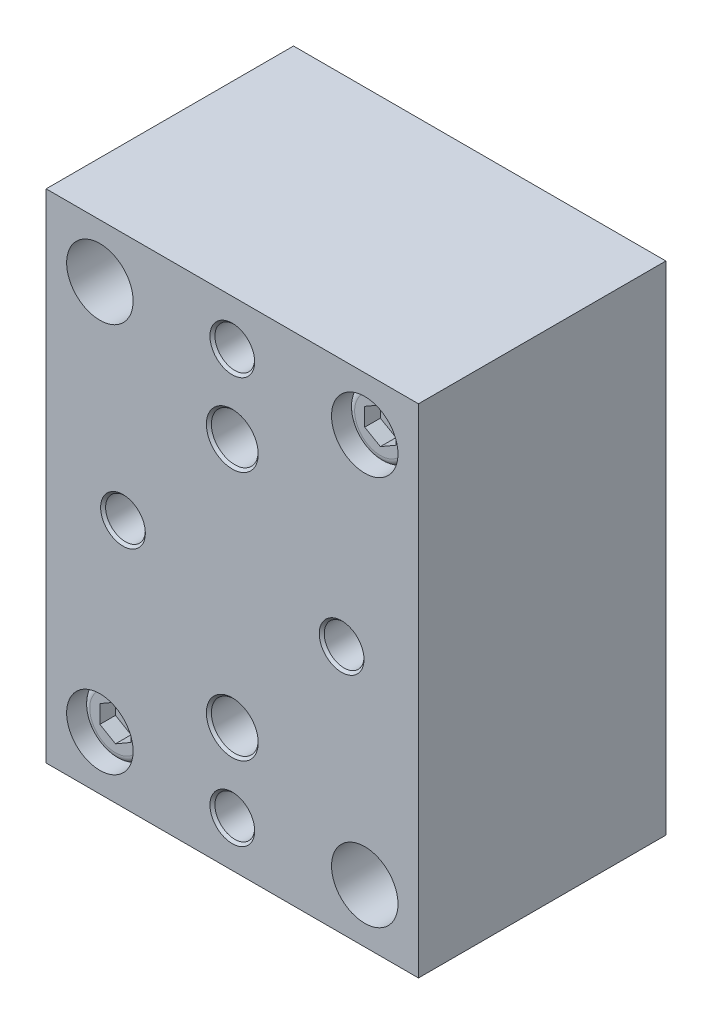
ISO-10303-21;
HEADER;
FILE_DESCRIPTION(('STEP AP214'),'2;1');
FILE_NAME('part.step','',(''),(''),'','','');
FILE_SCHEMA(('AUTOMOTIVE_DESIGN { 1 0 10303 214 1 1 1 1 }'));
ENDSEC;
DATA;
#1=APPLICATION_CONTEXT('core data for automotive mechanical design processes');
#2=APPLICATION_PROTOCOL_DEFINITION('international standard','automotive_design',2000,#1);
#3=PRODUCT_CONTEXT('',#1,'mechanical');
#4=PRODUCT('Part','Part','',(#3));
#5=PRODUCT_RELATED_PRODUCT_CATEGORY('part','',(#4));
#6=PRODUCT_DEFINITION_FORMATION('','',#4);
#7=PRODUCT_DEFINITION_CONTEXT('part definition',#1,'design');
#8=PRODUCT_DEFINITION('design','',#6,#7);
#9=PRODUCT_DEFINITION_SHAPE('','',#8);
#10=(LENGTH_UNIT() NAMED_UNIT(*) SI_UNIT(.MILLI.,.METRE.));
#11=(NAMED_UNIT(*) PLANE_ANGLE_UNIT() SI_UNIT($,.RADIAN.));
#12=(NAMED_UNIT(*) SI_UNIT($,.STERADIAN.) SOLID_ANGLE_UNIT());
#13=UNCERTAINTY_MEASURE_WITH_UNIT(LENGTH_MEASURE(1.E-05),#10,'distance_accuracy_value','');
#14=(GEOMETRIC_REPRESENTATION_CONTEXT(3) GLOBAL_UNCERTAINTY_ASSIGNED_CONTEXT((#13)) GLOBAL_UNIT_ASSIGNED_CONTEXT((#10,
#11,#12)) REPRESENTATION_CONTEXT('',''));
#15=CARTESIAN_POINT('',(0.,0.,0.));
#16=DIRECTION('',(0.,0.,1.));
#17=DIRECTION('',(1.,0.,0.));
#18=AXIS2_PLACEMENT_3D('',#15,#16,#17);
#19=CARTESIAN_POINT('',(-18.923,-25.273,23.5585));
#20=DIRECTION('',(0.,0.,1.));
#21=DIRECTION('',(1.,0.,0.));
#22=AXIS2_PLACEMENT_3D('',#19,#20,#21);
#23=PLANE('',#22);
#24=DIRECTION('',(-0.866025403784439,0.5,0.));
#25=VECTOR('',#24,1.);
#26=CARTESIAN_POINT('',(-11.8745,-18.8954564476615,23.5585));
#27=LINE('',#26,#25);
#28=CARTESIAN_POINT('',(-11.8745,-18.8954564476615,23.5585));
#29=VERTEX_POINT('',#28);
#30=CARTESIAN_POINT('',(-13.462,-17.9789128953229,23.5585));
#31=VERTEX_POINT('',#30);
#32=EDGE_CURVE('E61',#29,#31,#27,.T.);
#33=ORIENTED_EDGE('',*,*,#32,.F.);
#34=DIRECTION('',(0.,1.,0.));
#35=VECTOR('',#34,1.);
#36=CARTESIAN_POINT('',(-11.8745,-20.7285435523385,23.5585));
#37=LINE('',#36,#35);
#38=CARTESIAN_POINT('',(-11.8745,-20.7285435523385,23.5585));
#39=VERTEX_POINT('',#38);
#40=EDGE_CURVE('E144',#39,#29,#37,.T.);
#41=ORIENTED_EDGE('',*,*,#40,.F.);
#42=DIRECTION('',(0.866025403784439,0.5,0.));
#43=VECTOR('',#42,1.);
#44=CARTESIAN_POINT('',(-13.462,-21.6450871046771,23.5585));
#45=LINE('',#44,#43);
#46=CARTESIAN_POINT('',(-13.462,-21.6450871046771,23.5585));
#47=VERTEX_POINT('',#46);
#48=EDGE_CURVE('E142',#47,#39,#45,.T.);
#49=ORIENTED_EDGE('',*,*,#48,.F.);
#50=DIRECTION('',(0.866025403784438,-0.5,0.));
#51=VECTOR('',#50,1.);
#52=CARTESIAN_POINT('',(-15.0495,-20.7285435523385,23.5585));
#53=LINE('',#52,#51);
#54=CARTESIAN_POINT('',(-15.0495,-20.7285435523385,23.5585));
#55=VERTEX_POINT('',#54);
#56=EDGE_CURVE('E109',#55,#47,#53,.T.);
#57=ORIENTED_EDGE('',*,*,#56,.F.);
#58=DIRECTION('',(0.,-1.,0.));
#59=VECTOR('',#58,1.);
#60=CARTESIAN_POINT('',(-15.0495,-18.8954564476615,23.5585));
#61=LINE('',#60,#59);
#62=CARTESIAN_POINT('',(-15.0495,-18.8954564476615,23.5585));
#63=VERTEX_POINT('',#62);
#64=EDGE_CURVE('E138',#63,#55,#61,.T.);
#65=ORIENTED_EDGE('',*,*,#64,.F.);
#66=DIRECTION('',(-0.866025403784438,-0.5,0.));
#67=VECTOR('',#66,1.);
#68=CARTESIAN_POINT('',(-13.462,-17.9789128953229,23.5585));
#69=LINE('',#68,#67);
#70=EDGE_CURVE('E135',#31,#63,#69,.T.);
#71=ORIENTED_EDGE('',*,*,#70,.F.);
#72=EDGE_LOOP('',(#33,#41,#49,#57,#65,#71));
#73=FACE_BOUND('',#72,.T.);
#74=CARTESIAN_POINT('',(-13.462,-19.812,23.5585));
#75=DIRECTION('',(0.,0.,1.));
#76=DIRECTION('',(1.,0.,0.));
#77=AXIS2_PLACEMENT_3D('',#74,#75,#76);
#78=CIRCLE('',#77,2.6162);
#79=CARTESIAN_POINT('',(-10.8458,-19.812,23.5585));
#80=VERTEX_POINT('',#79);
#81=EDGE_CURVE('E12',#80,#80,#78,.T.);
#82=ORIENTED_EDGE('',*,*,#81,.T.);
#83=EDGE_LOOP('',(#82));
#84=FACE_BOUND('',#83,.T.);
#85=ADVANCED_FACE('F46',(#73,#84),#23,.T.);
#86=CARTESIAN_POINT('',(-13.462,-19.812,0.));
#87=DIRECTION('',(0.,0.,-1.));
#88=DIRECTION('',(-1.,0.,0.));
#89=AXIS2_PLACEMENT_3D('',#86,#87,#88);
#90=PLANE('',#89);
#91=CARTESIAN_POINT('',(-13.462,-19.812,0.));
#92=DIRECTION('',(0.,0.,-1.));
#93=DIRECTION('',(-1.,0.,0.));
#94=AXIS2_PLACEMENT_3D('',#91,#92,#93);
#95=CIRCLE('',#94,3.3782);
#96=CARTESIAN_POINT('',(-16.8402,-19.812,0.));
#97=VERTEX_POINT('',#96);
#98=EDGE_CURVE('E148',#97,#97,#95,.T.);
#99=ORIENTED_EDGE('',*,*,#98,.T.);
#100=EDGE_LOOP('',(#99));
#101=FACE_BOUND('',#100,.T.);
#102=ADVANCED_FACE('F170',(#101),#90,.T.);
#103=CARTESIAN_POINT('',(-13.462,-19.812,34.7009925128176));
#104=DIRECTION('',(0.,0.,-1.));
#105=DIRECTION('',(-1.,0.,0.));
#106=AXIS2_PLACEMENT_3D('',#103,#104,#105);
#107=CYLINDRICAL_SURFACE('',#106,3.3782);
#108=CARTESIAN_POINT('',(-13.462,-19.812,22.7965));
#109=DIRECTION('',(0.,0.,1.));
#110=DIRECTION('',(1.,0.,0.));
#111=AXIS2_PLACEMENT_3D('',#108,#109,#110);
#112=CIRCLE('',#111,3.3782);
#113=CARTESIAN_POINT('',(-10.0838,-19.812,22.7965));
#114=VERTEX_POINT('',#113);
#115=EDGE_CURVE('E54',#114,#114,#112,.F.);
#116=ORIENTED_EDGE('',*,*,#115,.T.);
#117=EDGE_LOOP('',(#116));
#118=FACE_BOUND('',#117,.T.);
#119=ORIENTED_EDGE('',*,*,#98,.F.);
#120=EDGE_LOOP('',(#119));
#121=FACE_BOUND('',#120,.T.);
#122=ADVANCED_FACE('F158',(#118,#121),#107,.T.);
#123=CARTESIAN_POINT('',(-13.462,-19.812,22.7965));
#124=DIRECTION('',(0.,0.,1.));
#125=DIRECTION('',(1.,0.,0.));
#126=AXIS2_PLACEMENT_3D('',#123,#124,#125);
#127=TOROIDAL_SURFACE('',#126,2.6162,0.762);
#128=ORIENTED_EDGE('',*,*,#81,.F.);
#129=EDGE_LOOP('',(#128));
#130=FACE_BOUND('',#129,.T.);
#131=ORIENTED_EDGE('',*,*,#115,.F.);
#132=EDGE_LOOP('',(#131));
#133=FACE_BOUND('',#132,.T.);
#134=ADVANCED_FACE('F48',(#130,#133),#127,.T.);
#135=CARTESIAN_POINT('',(-11.8745,-18.8954564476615,21.971));
#136=DIRECTION('',(0.5,0.866025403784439,0.));
#137=DIRECTION('',(-0.866025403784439,0.5,0.));
#138=AXIS2_PLACEMENT_3D('',#135,#136,#137);
#139=PLANE('',#138);
#140=ORIENTED_EDGE('',*,*,#32,.T.);
#141=DIRECTION('',(0.,0.,1.));
#142=VECTOR('',#141,1.);
#143=CARTESIAN_POINT('',(-13.462,-17.9789128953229,21.971));
#144=LINE('',#143,#142);
#145=CARTESIAN_POINT('',(-13.462,-17.9789128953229,21.971));
#146=VERTEX_POINT('',#145);
#147=EDGE_CURVE('E91',#146,#31,#144,.T.);
#148=ORIENTED_EDGE('',*,*,#147,.F.);
#149=DIRECTION('',(-0.866025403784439,0.5,0.));
#150=VECTOR('',#149,1.);
#151=CARTESIAN_POINT('',(-11.8745,-18.8954564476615,21.971));
#152=LINE('',#151,#150);
#153=CARTESIAN_POINT('',(-11.8745,-18.8954564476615,21.971));
#154=VERTEX_POINT('',#153);
#155=EDGE_CURVE('E146',#154,#146,#152,.T.);
#156=ORIENTED_EDGE('',*,*,#155,.F.);
#157=DIRECTION('',(0.,0.,1.));
#158=VECTOR('',#157,1.);
#159=CARTESIAN_POINT('',(-11.8745,-18.8954564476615,21.971));
#160=LINE('',#159,#158);
#161=EDGE_CURVE('E69',#154,#29,#160,.T.);
#162=ORIENTED_EDGE('',*,*,#161,.T.);
#163=EDGE_LOOP('',(#140,#148,#156,#162));
#164=FACE_BOUND('',#163,.T.);
#165=ADVANCED_FACE('F162',(#164),#139,.F.);
#166=CARTESIAN_POINT('',(-11.8745,-20.7285435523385,21.971));
#167=DIRECTION('',(1.,0.,0.));
#168=DIRECTION('',(0.,0.,-1.));
#169=AXIS2_PLACEMENT_3D('',#166,#167,#168);
#170=PLANE('',#169);
#171=ORIENTED_EDGE('',*,*,#40,.T.);
#172=ORIENTED_EDGE('',*,*,#161,.F.);
#173=DIRECTION('',(0.,1.,0.));
#174=VECTOR('',#173,1.);
#175=CARTESIAN_POINT('',(-11.8745,-20.7285435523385,21.971));
#176=LINE('',#175,#174);
#177=CARTESIAN_POINT('',(-11.8745,-20.7285435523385,21.971));
#178=VERTEX_POINT('',#177);
#179=EDGE_CURVE('E121',#178,#154,#176,.T.);
#180=ORIENTED_EDGE('',*,*,#179,.F.);
#181=DIRECTION('',(0.,0.,1.));
#182=VECTOR('',#181,1.);
#183=CARTESIAN_POINT('',(-11.8745,-20.7285435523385,21.971));
#184=LINE('',#183,#182);
#185=EDGE_CURVE('E113',#178,#39,#184,.T.);
#186=ORIENTED_EDGE('',*,*,#185,.T.);
#187=EDGE_LOOP('',(#171,#172,#180,#186));
#188=FACE_BOUND('',#187,.T.);
#189=ADVANCED_FACE('F168',(#188),#170,.F.);
#190=CARTESIAN_POINT('',(-13.462,-21.6450871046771,21.971));
#191=DIRECTION('',(0.5,-0.866025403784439,0.));
#192=DIRECTION('',(0.866025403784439,0.5,0.));
#193=AXIS2_PLACEMENT_3D('',#190,#191,#192);
#194=PLANE('',#193);
#195=ORIENTED_EDGE('',*,*,#48,.T.);
#196=ORIENTED_EDGE('',*,*,#185,.F.);
#197=DIRECTION('',(0.866025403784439,0.5,0.));
#198=VECTOR('',#197,1.);
#199=CARTESIAN_POINT('',(-13.462,-21.6450871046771,21.971));
#200=LINE('',#199,#198);
#201=CARTESIAN_POINT('',(-13.462,-21.6450871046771,21.971));
#202=VERTEX_POINT('',#201);
#203=EDGE_CURVE('E117',#202,#178,#200,.T.);
#204=ORIENTED_EDGE('',*,*,#203,.F.);
#205=DIRECTION('',(0.,0.,1.));
#206=VECTOR('',#205,1.);
#207=CARTESIAN_POINT('',(-13.462,-21.6450871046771,21.971));
#208=LINE('',#207,#206);
#209=EDGE_CURVE('E102',#202,#47,#208,.T.);
#210=ORIENTED_EDGE('',*,*,#209,.T.);
#211=EDGE_LOOP('',(#195,#196,#204,#210));
#212=FACE_BOUND('',#211,.T.);
#213=ADVANCED_FACE('F118',(#212),#194,.F.);
#214=CARTESIAN_POINT('',(-15.0495,-20.7285435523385,21.971));
#215=DIRECTION('',(-0.5,-0.866025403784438,0.));
#216=DIRECTION('',(0.866025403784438,-0.5,0.));
#217=AXIS2_PLACEMENT_3D('',#214,#215,#216);
#218=PLANE('',#217);
#219=ORIENTED_EDGE('',*,*,#56,.T.);
#220=ORIENTED_EDGE('',*,*,#209,.F.);
#221=DIRECTION('',(0.866025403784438,-0.5,0.));
#222=VECTOR('',#221,1.);
#223=CARTESIAN_POINT('',(-15.0495,-20.7285435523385,21.971));
#224=LINE('',#223,#222);
#225=CARTESIAN_POINT('',(-15.0495,-20.7285435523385,21.971));
#226=VERTEX_POINT('',#225);
#227=EDGE_CURVE('E106',#226,#202,#224,.T.);
#228=ORIENTED_EDGE('',*,*,#227,.F.);
#229=DIRECTION('',(0.,0.,1.));
#230=VECTOR('',#229,1.);
#231=CARTESIAN_POINT('',(-15.0495,-20.7285435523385,21.971));
#232=LINE('',#231,#230);
#233=EDGE_CURVE('E114',#226,#55,#232,.T.);
#234=ORIENTED_EDGE('',*,*,#233,.T.);
#235=EDGE_LOOP('',(#219,#220,#228,#234));
#236=FACE_BOUND('',#235,.T.);
#237=ADVANCED_FACE('F104',(#236),#218,.F.);
#238=CARTESIAN_POINT('',(-15.0495,-18.8954564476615,21.971));
#239=DIRECTION('',(-1.,0.,0.));
#240=DIRECTION('',(0.,0.,1.));
#241=AXIS2_PLACEMENT_3D('',#238,#239,#240);
#242=PLANE('',#241);
#243=ORIENTED_EDGE('',*,*,#64,.T.);
#244=ORIENTED_EDGE('',*,*,#233,.F.);
#245=DIRECTION('',(0.,-1.,0.));
#246=VECTOR('',#245,1.);
#247=CARTESIAN_POINT('',(-15.0495,-18.8954564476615,21.971));
#248=LINE('',#247,#246);
#249=CARTESIAN_POINT('',(-15.0495,-18.8954564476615,21.971));
#250=VERTEX_POINT('',#249);
#251=EDGE_CURVE('E127',#250,#226,#248,.T.);
#252=ORIENTED_EDGE('',*,*,#251,.F.);
#253=DIRECTION('',(0.,0.,1.));
#254=VECTOR('',#253,1.);
#255=CARTESIAN_POINT('',(-15.0495,-18.8954564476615,21.971));
#256=LINE('',#255,#254);
#257=EDGE_CURVE('E151',#250,#63,#256,.T.);
#258=ORIENTED_EDGE('',*,*,#257,.T.);
#259=EDGE_LOOP('',(#243,#244,#252,#258));
#260=FACE_BOUND('',#259,.T.);
#261=ADVANCED_FACE('F185',(#260),#242,.F.);
#262=CARTESIAN_POINT('',(-13.462,-17.9789128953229,21.971));
#263=DIRECTION('',(-0.5,0.866025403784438,0.));
#264=DIRECTION('',(-0.866025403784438,-0.5,0.));
#265=AXIS2_PLACEMENT_3D('',#262,#263,#264);
#266=PLANE('',#265);
#267=ORIENTED_EDGE('',*,*,#70,.T.);
#268=ORIENTED_EDGE('',*,*,#257,.F.);
#269=DIRECTION('',(-0.866025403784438,-0.5,0.));
#270=VECTOR('',#269,1.);
#271=CARTESIAN_POINT('',(-13.462,-17.9789128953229,21.971));
#272=LINE('',#271,#270);
#273=EDGE_CURVE('E129',#146,#250,#272,.T.);
#274=ORIENTED_EDGE('',*,*,#273,.F.);
#275=ORIENTED_EDGE('',*,*,#147,.T.);
#276=EDGE_LOOP('',(#267,#268,#274,#275));
#277=FACE_BOUND('',#276,.T.);
#278=ADVANCED_FACE('F182',(#277),#266,.F.);
#279=CARTESIAN_POINT('',(0.,0.,21.971));
#280=DIRECTION('',(0.,0.,1.));
#281=DIRECTION('',(1.,0.,0.));
#282=AXIS2_PLACEMENT_3D('',#279,#280,#281);
#283=PLANE('',#282);
#284=ORIENTED_EDGE('',*,*,#155,.T.);
#285=ORIENTED_EDGE('',*,*,#273,.T.);
#286=ORIENTED_EDGE('',*,*,#251,.T.);
#287=ORIENTED_EDGE('',*,*,#227,.T.);
#288=ORIENTED_EDGE('',*,*,#203,.T.);
#289=ORIENTED_EDGE('',*,*,#179,.T.);
#290=EDGE_LOOP('',(#284,#285,#286,#287,#288,#289));
#291=FACE_BOUND('',#290,.T.);
#292=ADVANCED_FACE('F124',(#291),#283,.T.);
#293=CLOSED_SHELL('',(#85,#102,#122,#134,#165,#189,#213,#237,#261,#278,#292));
#294=MANIFOLD_SOLID_BREP('B2',#293);
#295=CARTESIAN_POINT('',(-18.923,-25.273,23.5585));
#296=DIRECTION('',(0.,0.,1.));
#297=DIRECTION('',(1.,0.,0.));
#298=AXIS2_PLACEMENT_3D('',#295,#296,#297);
#299=PLANE('',#298);
#300=DIRECTION('',(-0.866025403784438,0.5,0.));
#301=VECTOR('',#300,1.);
#302=CARTESIAN_POINT('',(15.0495,20.7285435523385,23.5585));
#303=LINE('',#302,#301);
#304=CARTESIAN_POINT('',(15.0495,20.7285435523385,23.5585));
#305=VERTEX_POINT('',#304);
#306=CARTESIAN_POINT('',(13.462,21.6450871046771,23.5585));
#307=VERTEX_POINT('',#306);
#308=EDGE_CURVE('E292',#305,#307,#303,.T.);
#309=ORIENTED_EDGE('',*,*,#308,.F.);
#310=DIRECTION('',(0.,1.,0.));
#311=VECTOR('',#310,1.);
#312=CARTESIAN_POINT('',(15.0495,18.8954564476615,23.5585));
#313=LINE('',#312,#311);
#314=CARTESIAN_POINT('',(15.0495,18.8954564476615,23.5585));
#315=VERTEX_POINT('',#314);
#316=EDGE_CURVE('E375',#315,#305,#313,.T.);
#317=ORIENTED_EDGE('',*,*,#316,.F.);
#318=DIRECTION('',(0.866025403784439,0.499999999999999,0.));
#319=VECTOR('',#318,1.);
#320=CARTESIAN_POINT('',(13.462,17.9789128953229,23.5585));
#321=LINE('',#320,#319);
#322=CARTESIAN_POINT('',(13.462,17.9789128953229,23.5585));
#323=VERTEX_POINT('',#322);
#324=EDGE_CURVE('E373',#323,#315,#321,.T.);
#325=ORIENTED_EDGE('',*,*,#324,.F.);
#326=DIRECTION('',(0.866025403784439,-0.499999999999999,0.));
#327=VECTOR('',#326,1.);
#328=CARTESIAN_POINT('',(11.8745,18.8954564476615,23.5585));
#329=LINE('',#328,#327);
#330=CARTESIAN_POINT('',(11.8745,18.8954564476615,23.5585));
#331=VERTEX_POINT('',#330);
#332=EDGE_CURVE('E340',#331,#323,#329,.T.);
#333=ORIENTED_EDGE('',*,*,#332,.F.);
#334=DIRECTION('',(0.,-1.,0.));
#335=VECTOR('',#334,1.);
#336=CARTESIAN_POINT('',(11.8745,20.7285435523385,23.5585));
#337=LINE('',#336,#335);
#338=CARTESIAN_POINT('',(11.8745,20.7285435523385,23.5585));
#339=VERTEX_POINT('',#338);
#340=EDGE_CURVE('E369',#339,#331,#337,.T.);
#341=ORIENTED_EDGE('',*,*,#340,.F.);
#342=DIRECTION('',(-0.866025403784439,-0.5,0.));
#343=VECTOR('',#342,1.);
#344=CARTESIAN_POINT('',(13.462,21.6450871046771,23.5585));
#345=LINE('',#344,#343);
#346=EDGE_CURVE('E366',#307,#339,#345,.T.);
#347=ORIENTED_EDGE('',*,*,#346,.F.);
#348=EDGE_LOOP('',(#309,#317,#325,#333,#341,#347));
#349=FACE_BOUND('',#348,.T.);
#350=CARTESIAN_POINT('',(13.462,19.812,23.5585));
#351=DIRECTION('',(0.,0.,1.));
#352=DIRECTION('',(1.,0.,0.));
#353=AXIS2_PLACEMENT_3D('',#350,#351,#352);
#354=CIRCLE('',#353,2.6162);
#355=CARTESIAN_POINT('',(16.0782,19.812,23.5585));
#356=VERTEX_POINT('',#355);
#357=EDGE_CURVE('E44',#356,#356,#354,.T.);
#358=ORIENTED_EDGE('',*,*,#357,.T.);
#359=EDGE_LOOP('',(#358));
#360=FACE_BOUND('',#359,.T.);
#361=ADVANCED_FACE('F277',(#349,#360),#299,.T.);
#362=CARTESIAN_POINT('',(13.462,19.812,0.));
#363=DIRECTION('',(0.,0.,-1.));
#364=DIRECTION('',(-1.,0.,0.));
#365=AXIS2_PLACEMENT_3D('',#362,#363,#364);
#366=PLANE('',#365);
#367=CARTESIAN_POINT('',(13.462,19.812,0.));
#368=DIRECTION('',(0.,0.,-1.));
#369=DIRECTION('',(-1.,0.,0.));
#370=AXIS2_PLACEMENT_3D('',#367,#368,#369);
#371=CIRCLE('',#370,3.3782);
#372=CARTESIAN_POINT('',(10.0838,19.812,0.));
#373=VERTEX_POINT('',#372);
#374=EDGE_CURVE('E379',#373,#373,#371,.T.);
#375=ORIENTED_EDGE('',*,*,#374,.T.);
#376=EDGE_LOOP('',(#375));
#377=FACE_BOUND('',#376,.T.);
#378=ADVANCED_FACE('F401',(#377),#366,.T.);
#379=CARTESIAN_POINT('',(13.462,19.812,34.7009925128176));
#380=DIRECTION('',(0.,0.,-1.));
#381=DIRECTION('',(-1.,0.,0.));
#382=AXIS2_PLACEMENT_3D('',#379,#380,#381);
#383=CYLINDRICAL_SURFACE('',#382,3.3782);
#384=CARTESIAN_POINT('',(13.462,19.812,22.7965));
#385=DIRECTION('',(0.,0.,1.));
#386=DIRECTION('',(1.,0.,0.));
#387=AXIS2_PLACEMENT_3D('',#384,#385,#386);
#388=CIRCLE('',#387,3.3782);
#389=CARTESIAN_POINT('',(16.8402,19.812,22.7965));
#390=VERTEX_POINT('',#389);
#391=EDGE_CURVE('E285',#390,#390,#388,.F.);
#392=ORIENTED_EDGE('',*,*,#391,.T.);
#393=EDGE_LOOP('',(#392));
#394=FACE_BOUND('',#393,.T.);
#395=ORIENTED_EDGE('',*,*,#374,.F.);
#396=EDGE_LOOP('',(#395));
#397=FACE_BOUND('',#396,.T.);
#398=ADVANCED_FACE('F389',(#394,#397),#383,.T.);
#399=CARTESIAN_POINT('',(13.462,19.812,22.7965));
#400=DIRECTION('',(0.,0.,1.));
#401=DIRECTION('',(1.,0.,0.));
#402=AXIS2_PLACEMENT_3D('',#399,#400,#401);
#403=TOROIDAL_SURFACE('',#402,2.6162,0.762);
#404=ORIENTED_EDGE('',*,*,#357,.F.);
#405=EDGE_LOOP('',(#404));
#406=FACE_BOUND('',#405,.T.);
#407=ORIENTED_EDGE('',*,*,#391,.F.);
#408=EDGE_LOOP('',(#407));
#409=FACE_BOUND('',#408,.T.);
#410=ADVANCED_FACE('F279',(#406,#409),#403,.T.);
#411=CARTESIAN_POINT('',(15.0495,20.7285435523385,21.971));
#412=DIRECTION('',(0.5,0.866025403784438,0.));
#413=DIRECTION('',(-0.866025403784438,0.5,0.));
#414=AXIS2_PLACEMENT_3D('',#411,#412,#413);
#415=PLANE('',#414);
#416=ORIENTED_EDGE('',*,*,#308,.T.);
#417=DIRECTION('',(0.,0.,1.));
#418=VECTOR('',#417,1.);
#419=CARTESIAN_POINT('',(13.462,21.6450871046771,21.971));
#420=LINE('',#419,#418);
#421=CARTESIAN_POINT('',(13.462,21.6450871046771,21.971));
#422=VERTEX_POINT('',#421);
#423=EDGE_CURVE('E322',#422,#307,#420,.T.);
#424=ORIENTED_EDGE('',*,*,#423,.F.);
#425=DIRECTION('',(-0.866025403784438,0.5,0.));
#426=VECTOR('',#425,1.);
#427=CARTESIAN_POINT('',(15.0495,20.7285435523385,21.971));
#428=LINE('',#427,#426);
#429=CARTESIAN_POINT('',(15.0495,20.7285435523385,21.971));
#430=VERTEX_POINT('',#429);
#431=EDGE_CURVE('E377',#430,#422,#428,.T.);
#432=ORIENTED_EDGE('',*,*,#431,.F.);
#433=DIRECTION('',(0.,0.,1.));
#434=VECTOR('',#433,1.);
#435=CARTESIAN_POINT('',(15.0495,20.7285435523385,21.971));
#436=LINE('',#435,#434);
#437=EDGE_CURVE('E300',#430,#305,#436,.T.);
#438=ORIENTED_EDGE('',*,*,#437,.T.);
#439=EDGE_LOOP('',(#416,#424,#432,#438));
#440=FACE_BOUND('',#439,.T.);
#441=ADVANCED_FACE('F393',(#440),#415,.F.);
#442=CARTESIAN_POINT('',(15.0495,18.8954564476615,21.971));
#443=DIRECTION('',(1.,0.,0.));
#444=DIRECTION('',(0.,0.,-1.));
#445=AXIS2_PLACEMENT_3D('',#442,#443,#444);
#446=PLANE('',#445);
#447=ORIENTED_EDGE('',*,*,#316,.T.);
#448=ORIENTED_EDGE('',*,*,#437,.F.);
#449=DIRECTION('',(0.,1.,0.));
#450=VECTOR('',#449,1.);
#451=CARTESIAN_POINT('',(15.0495,18.8954564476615,21.971));
#452=LINE('',#451,#450);
#453=CARTESIAN_POINT('',(15.0495,18.8954564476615,21.971));
#454=VERTEX_POINT('',#453);
#455=EDGE_CURVE('E352',#454,#430,#452,.T.);
#456=ORIENTED_EDGE('',*,*,#455,.F.);
#457=DIRECTION('',(0.,0.,1.));
#458=VECTOR('',#457,1.);
#459=CARTESIAN_POINT('',(15.0495,18.8954564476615,21.971));
#460=LINE('',#459,#458);
#461=EDGE_CURVE('E344',#454,#315,#460,.T.);
#462=ORIENTED_EDGE('',*,*,#461,.T.);
#463=EDGE_LOOP('',(#447,#448,#456,#462));
#464=FACE_BOUND('',#463,.T.);
#465=ADVANCED_FACE('F399',(#464),#446,.F.);
#466=CARTESIAN_POINT('',(13.462,17.9789128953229,21.971));
#467=DIRECTION('',(0.499999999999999,-0.866025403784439,0.));
#468=DIRECTION('',(0.86602540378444,0.499999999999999,0.));
#469=AXIS2_PLACEMENT_3D('',#466,#467,#468);
#470=PLANE('',#469);
#471=ORIENTED_EDGE('',*,*,#324,.T.);
#472=ORIENTED_EDGE('',*,*,#461,.F.);
#473=DIRECTION('',(0.866025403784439,0.499999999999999,0.));
#474=VECTOR('',#473,1.);
#475=CARTESIAN_POINT('',(13.462,17.9789128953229,21.971));
#476=LINE('',#475,#474);
#477=CARTESIAN_POINT('',(13.462,17.9789128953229,21.971));
#478=VERTEX_POINT('',#477);
#479=EDGE_CURVE('E348',#478,#454,#476,.T.);
#480=ORIENTED_EDGE('',*,*,#479,.F.);
#481=DIRECTION('',(0.,0.,1.));
#482=VECTOR('',#481,1.);
#483=CARTESIAN_POINT('',(13.462,17.9789128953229,21.971));
#484=LINE('',#483,#482);
#485=EDGE_CURVE('E333',#478,#323,#484,.T.);
#486=ORIENTED_EDGE('',*,*,#485,.T.);
#487=EDGE_LOOP('',(#471,#472,#480,#486));
#488=FACE_BOUND('',#487,.T.);
#489=ADVANCED_FACE('F349',(#488),#470,.F.);
#490=CARTESIAN_POINT('',(11.8745,18.8954564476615,21.971));
#491=DIRECTION('',(-0.499999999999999,-0.866025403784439,0.));
#492=DIRECTION('',(0.866025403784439,-0.499999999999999,0.));
#493=AXIS2_PLACEMENT_3D('',#490,#491,#492);
#494=PLANE('',#493);
#495=ORIENTED_EDGE('',*,*,#332,.T.);
#496=ORIENTED_EDGE('',*,*,#485,.F.);
#497=DIRECTION('',(0.866025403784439,-0.499999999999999,0.));
#498=VECTOR('',#497,1.);
#499=CARTESIAN_POINT('',(11.8745,18.8954564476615,21.971));
#500=LINE('',#499,#498);
#501=CARTESIAN_POINT('',(11.8745,18.8954564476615,21.971));
#502=VERTEX_POINT('',#501);
#503=EDGE_CURVE('E337',#502,#478,#500,.T.);
#504=ORIENTED_EDGE('',*,*,#503,.F.);
#505=DIRECTION('',(0.,0.,1.));
#506=VECTOR('',#505,1.);
#507=CARTESIAN_POINT('',(11.8745,18.8954564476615,21.971));
#508=LINE('',#507,#506);
#509=EDGE_CURVE('E345',#502,#331,#508,.T.);
#510=ORIENTED_EDGE('',*,*,#509,.T.);
#511=EDGE_LOOP('',(#495,#496,#504,#510));
#512=FACE_BOUND('',#511,.T.);
#513=ADVANCED_FACE('F335',(#512),#494,.F.);
#514=CARTESIAN_POINT('',(11.8745,20.7285435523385,21.971));
#515=DIRECTION('',(-1.,0.,0.));
#516=DIRECTION('',(0.,0.,1.));
#517=AXIS2_PLACEMENT_3D('',#514,#515,#516);
#518=PLANE('',#517);
#519=ORIENTED_EDGE('',*,*,#340,.T.);
#520=ORIENTED_EDGE('',*,*,#509,.F.);
#521=DIRECTION('',(0.,-1.,0.));
#522=VECTOR('',#521,1.);
#523=CARTESIAN_POINT('',(11.8745,20.7285435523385,21.971));
#524=LINE('',#523,#522);
#525=CARTESIAN_POINT('',(11.8745,20.7285435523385,21.971));
#526=VERTEX_POINT('',#525);
#527=EDGE_CURVE('E358',#526,#502,#524,.T.);
#528=ORIENTED_EDGE('',*,*,#527,.F.);
#529=DIRECTION('',(0.,0.,1.));
#530=VECTOR('',#529,1.);
#531=CARTESIAN_POINT('',(11.8745,20.7285435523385,21.971));
#532=LINE('',#531,#530);
#533=EDGE_CURVE('E382',#526,#339,#532,.T.);
#534=ORIENTED_EDGE('',*,*,#533,.T.);
#535=EDGE_LOOP('',(#519,#520,#528,#534));
#536=FACE_BOUND('',#535,.T.);
#537=ADVANCED_FACE('F416',(#536),#518,.F.);
#538=CARTESIAN_POINT('',(13.462,21.6450871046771,21.971));
#539=DIRECTION('',(-0.5,0.866025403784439,0.));
#540=DIRECTION('',(-0.866025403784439,-0.5,0.));
#541=AXIS2_PLACEMENT_3D('',#538,#539,#540);
#542=PLANE('',#541);
#543=ORIENTED_EDGE('',*,*,#346,.T.);
#544=ORIENTED_EDGE('',*,*,#533,.F.);
#545=DIRECTION('',(-0.866025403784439,-0.5,0.));
#546=VECTOR('',#545,1.);
#547=CARTESIAN_POINT('',(13.462,21.6450871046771,21.971));
#548=LINE('',#547,#546);
#549=EDGE_CURVE('E360',#422,#526,#548,.T.);
#550=ORIENTED_EDGE('',*,*,#549,.F.);
#551=ORIENTED_EDGE('',*,*,#423,.T.);
#552=EDGE_LOOP('',(#543,#544,#550,#551));
#553=FACE_BOUND('',#552,.T.);
#554=ADVANCED_FACE('F413',(#553),#542,.F.);
#555=CARTESIAN_POINT('',(0.,0.,21.971));
#556=DIRECTION('',(0.,0.,1.));
#557=DIRECTION('',(1.,0.,0.));
#558=AXIS2_PLACEMENT_3D('',#555,#556,#557);
#559=PLANE('',#558);
#560=ORIENTED_EDGE('',*,*,#431,.T.);
#561=ORIENTED_EDGE('',*,*,#549,.T.);
#562=ORIENTED_EDGE('',*,*,#527,.T.);
#563=ORIENTED_EDGE('',*,*,#503,.T.);
#564=ORIENTED_EDGE('',*,*,#479,.T.);
#565=ORIENTED_EDGE('',*,*,#455,.T.);
#566=EDGE_LOOP('',(#560,#561,#562,#563,#564,#565));
#567=FACE_BOUND('',#566,.T.);
#568=ADVANCED_FACE('F355',(#567),#559,.T.);
#569=CLOSED_SHELL('',(#361,#378,#398,#410,#441,#465,#489,#513,#537,#554,#568));
#570=MANIFOLD_SOLID_BREP('B6',#569);
#571=CARTESIAN_POINT('',(-18.923,-25.273,25.146));
#572=DIRECTION('',(0.,0.,1.));
#573=DIRECTION('',(1.,0.,0.));
#574=AXIS2_PLACEMENT_3D('',#571,#572,#573);
#575=PLANE('',#574);
#576=CARTESIAN_POINT('',(-11.1125,0.,25.146));
#577=DIRECTION('',(0.,0.,1.));
#578=DIRECTION('',(1.,0.,0.));
#579=AXIS2_PLACEMENT_3D('',#576,#577,#578);
#580=CIRCLE('',#579,2.27329999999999);
#581=CARTESIAN_POINT('',(-8.83920000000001,0.,25.146));
#582=VERTEX_POINT('',#581);
#583=EDGE_CURVE('E595',#582,#582,#580,.F.);
#584=ORIENTED_EDGE('',*,*,#583,.T.);
#585=EDGE_LOOP('',(#584));
#586=FACE_BOUND('',#585,.T.);
#587=CARTESIAN_POINT('',(11.1125,0.,25.146));
#588=DIRECTION('',(0.,0.,1.));
#589=DIRECTION('',(1.,0.,0.));
#590=AXIS2_PLACEMENT_3D('',#587,#588,#589);
#591=CIRCLE('',#590,2.27329999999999);
#592=CARTESIAN_POINT('',(13.3858,0.,25.146));
#593=VERTEX_POINT('',#592);
#594=EDGE_CURVE('E592',#593,#593,#591,.F.);
#595=ORIENTED_EDGE('',*,*,#594,.T.);
#596=EDGE_LOOP('',(#595));
#597=FACE_BOUND('',#596,.T.);
#598=CARTESIAN_POINT('',(0.,-20.6375,25.146));
#599=DIRECTION('',(0.,0.,1.));
#600=DIRECTION('',(1.,0.,0.));
#601=AXIS2_PLACEMENT_3D('',#598,#599,#600);
#602=CIRCLE('',#601,2.27329999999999);
#603=CARTESIAN_POINT('',(2.27329999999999,-20.6375,25.146));
#604=VERTEX_POINT('',#603);
#605=EDGE_CURVE('E589',#604,#604,#602,.F.);
#606=ORIENTED_EDGE('',*,*,#605,.T.);
#607=EDGE_LOOP('',(#606));
#608=FACE_BOUND('',#607,.T.);
#609=CARTESIAN_POINT('',(0.,-12.7,25.146));
#610=DIRECTION('',(0.,0.,1.));
#611=DIRECTION('',(1.,0.,0.));
#612=AXIS2_PLACEMENT_3D('',#609,#610,#611);
#613=CIRCLE('',#612,2.63525000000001);
#614=CARTESIAN_POINT('',(2.63525000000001,-12.7,25.146));
#615=VERTEX_POINT('',#614);
#616=EDGE_CURVE('E586',#615,#615,#613,.F.);
#617=ORIENTED_EDGE('',*,*,#616,.T.);
#618=EDGE_LOOP('',(#617));
#619=FACE_BOUND('',#618,.T.);
#620=CARTESIAN_POINT('',(0.,20.6375,25.146));
#621=DIRECTION('',(0.,0.,1.));
#622=DIRECTION('',(1.,0.,0.));
#623=AXIS2_PLACEMENT_3D('',#620,#621,#622);
#624=CIRCLE('',#623,2.27329999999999);
#625=CARTESIAN_POINT('',(2.27329999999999,20.6375,25.146));
#626=VERTEX_POINT('',#625);
#627=EDGE_CURVE('E583',#626,#626,#624,.F.);
#628=ORIENTED_EDGE('',*,*,#627,.T.);
#629=EDGE_LOOP('',(#628));
#630=FACE_BOUND('',#629,.T.);
#631=CARTESIAN_POINT('',(0.,12.7,25.146));
#632=DIRECTION('',(0.,0.,1.));
#633=DIRECTION('',(1.,0.,0.));
#634=AXIS2_PLACEMENT_3D('',#631,#632,#633);
#635=CIRCLE('',#634,2.63525000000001);
#636=CARTESIAN_POINT('',(2.63525000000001,12.7,25.146));
#637=VERTEX_POINT('',#636);
#638=EDGE_CURVE('E580',#637,#637,#635,.F.);
#639=ORIENTED_EDGE('',*,*,#638,.T.);
#640=EDGE_LOOP('',(#639));
#641=FACE_BOUND('',#640,.T.);
#642=DIRECTION('',(0.,-1.,0.));
#643=VECTOR('',#642,1.);
#644=CARTESIAN_POINT('',(-18.923,25.273,25.146));
#645=LINE('',#644,#643);
#646=CARTESIAN_POINT('',(-18.923,25.273,25.146));
#647=VERTEX_POINT('',#646);
#648=CARTESIAN_POINT('',(-18.923,-25.273,25.146));
#649=VERTEX_POINT('',#648);
#650=EDGE_CURVE('E552',#647,#649,#645,.T.);
#651=ORIENTED_EDGE('',*,*,#650,.T.);
#652=DIRECTION('',(1.,0.,0.));
#653=VECTOR('',#652,1.);
#654=CARTESIAN_POINT('',(-18.923,-25.273,25.146));
#655=LINE('',#654,#653);
#656=CARTESIAN_POINT('',(18.923,-25.273,25.146));
#657=VERTEX_POINT('',#656);
#658=EDGE_CURVE('E547',#649,#657,#655,.T.);
#659=ORIENTED_EDGE('',*,*,#658,.T.);
#660=DIRECTION('',(0.,1.,0.));
#661=VECTOR('',#660,1.);
#662=CARTESIAN_POINT('',(18.923,25.273,25.146));
#663=LINE('',#662,#661);
#664=CARTESIAN_POINT('',(18.923,25.273,25.146));
#665=VERTEX_POINT('',#664);
#666=EDGE_CURVE('E550',#657,#665,#663,.T.);
#667=ORIENTED_EDGE('',*,*,#666,.T.);
#668=DIRECTION('',(-1.,0.,0.));
#669=VECTOR('',#668,1.);
#670=CARTESIAN_POINT('',(-18.923,25.273,25.146));
#671=LINE('',#670,#669);
#672=EDGE_CURVE('E516',#665,#647,#671,.T.);
#673=ORIENTED_EDGE('',*,*,#672,.T.);
#674=EDGE_LOOP('',(#651,#659,#667,#673));
#675=FACE_BOUND('',#674,.T.);
#676=CARTESIAN_POINT('',(-13.462,19.812,25.146));
#677=DIRECTION('',(0.,0.,1.));
#678=DIRECTION('',(1.,0.,0.));
#679=AXIS2_PLACEMENT_3D('',#676,#677,#678);
#680=CIRCLE('',#679,3.3782);
#681=CARTESIAN_POINT('',(-10.0838,19.812,25.146));
#682=VERTEX_POINT('',#681);
#683=EDGE_CURVE('E717',#682,#682,#680,.T.);
#684=ORIENTED_EDGE('',*,*,#683,.F.);
#685=EDGE_LOOP('',(#684));
#686=FACE_BOUND('',#685,.T.);
#687=CARTESIAN_POINT('',(13.462,19.812,25.146));
#688=DIRECTION('',(0.,0.,1.));
#689=DIRECTION('',(1.,0.,0.));
#690=AXIS2_PLACEMENT_3D('',#687,#688,#689);
#691=CIRCLE('',#690,3.3782);
#692=CARTESIAN_POINT('',(16.8402,19.812,25.146));
#693=VERTEX_POINT('',#692);
#694=EDGE_CURVE('E711',#693,#693,#691,.T.);
#695=ORIENTED_EDGE('',*,*,#694,.F.);
#696=EDGE_LOOP('',(#695));
#697=FACE_BOUND('',#696,.T.);
#698=CARTESIAN_POINT('',(-13.462,-19.812,25.146));
#699=DIRECTION('',(0.,0.,1.));
#700=DIRECTION('',(1.,0.,0.));
#701=AXIS2_PLACEMENT_3D('',#698,#699,#700);
#702=CIRCLE('',#701,3.3782);
#703=CARTESIAN_POINT('',(-10.0838,-19.812,25.146));
#704=VERTEX_POINT('',#703);
#705=EDGE_CURVE('E705',#704,#704,#702,.T.);
#706=ORIENTED_EDGE('',*,*,#705,.F.);
#707=EDGE_LOOP('',(#706));
#708=FACE_BOUND('',#707,.T.);
#709=CARTESIAN_POINT('',(13.462,-19.812,25.146));
#710=DIRECTION('',(0.,0.,1.));
#711=DIRECTION('',(1.,0.,0.));
#712=AXIS2_PLACEMENT_3D('',#709,#710,#711);
#713=CIRCLE('',#712,3.3782);
#714=CARTESIAN_POINT('',(16.8402,-19.812,25.146));
#715=VERTEX_POINT('',#714);
#716=EDGE_CURVE('E701',#715,#715,#713,.T.);
#717=ORIENTED_EDGE('',*,*,#716,.F.);
#718=EDGE_LOOP('',(#717));
#719=FACE_BOUND('',#718,.T.);
#720=ADVANCED_FACE('F499',(#586,#597,#608,#619,#630,#641,#675,#686,#697,#708,#719),#575,.T.);
#721=CARTESIAN_POINT('',(-18.923,-25.273,0.));
#722=DIRECTION('',(0.,0.,1.));
#723=DIRECTION('',(1.,0.,0.));
#724=AXIS2_PLACEMENT_3D('',#721,#722,#723);
#725=PLANE('',#724);
#726=CARTESIAN_POINT('',(-11.1125,0.,0.));
#727=DIRECTION('',(0.,0.,1.));
#728=DIRECTION('',(1.,0.,0.));
#729=AXIS2_PLACEMENT_3D('',#726,#727,#728);
#730=CIRCLE('',#729,2.01929999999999);
#731=CARTESIAN_POINT('',(-9.09320000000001,0.,0.));
#732=VERTEX_POINT('',#731);
#733=EDGE_CURVE('E957',#732,#732,#730,.T.);
#734=ORIENTED_EDGE('',*,*,#733,.T.);
#735=EDGE_LOOP('',(#734));
#736=FACE_BOUND('',#735,.T.);
#737=CARTESIAN_POINT('',(11.1125,0.,0.));
#738=DIRECTION('',(0.,0.,1.));
#739=DIRECTION('',(1.,0.,0.));
#740=AXIS2_PLACEMENT_3D('',#737,#738,#739);
#741=CIRCLE('',#740,2.01929999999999);
#742=CARTESIAN_POINT('',(13.1318,0.,0.));
#743=VERTEX_POINT('',#742);
#744=EDGE_CURVE('E683',#743,#743,#741,.T.);
#745=ORIENTED_EDGE('',*,*,#744,.T.);
#746=EDGE_LOOP('',(#745));
#747=FACE_BOUND('',#746,.T.);
#748=CARTESIAN_POINT('',(0.,20.6375,0.));
#749=DIRECTION('',(0.,0.,1.));
#750=DIRECTION('',(1.,0.,0.));
#751=AXIS2_PLACEMENT_3D('',#748,#749,#750);
#752=CIRCLE('',#751,2.01929999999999);
#753=CARTESIAN_POINT('',(2.01929999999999,20.6375,0.));
#754=VERTEX_POINT('',#753);
#755=EDGE_CURVE('E677',#754,#754,#752,.T.);
#756=ORIENTED_EDGE('',*,*,#755,.T.);
#757=EDGE_LOOP('',(#756));
#758=FACE_BOUND('',#757,.T.);
#759=CARTESIAN_POINT('',(0.,-20.6375,0.));
#760=DIRECTION('',(0.,0.,1.));
#761=DIRECTION('',(1.,0.,0.));
#762=AXIS2_PLACEMENT_3D('',#759,#760,#761);
#763=CIRCLE('',#762,2.01929999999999);
#764=CARTESIAN_POINT('',(2.01929999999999,-20.6375,0.));
#765=VERTEX_POINT('',#764);
#766=EDGE_CURVE('E674',#765,#765,#763,.T.);
#767=ORIENTED_EDGE('',*,*,#766,.T.);
#768=EDGE_LOOP('',(#767));
#769=FACE_BOUND('',#768,.T.);
#770=DIRECTION('',(0.,-1.,0.));
#771=VECTOR('',#770,1.);
#772=CARTESIAN_POINT('',(-18.923,25.273,0.));
#773=LINE('',#772,#771);
#774=CARTESIAN_POINT('',(-18.923,25.273,0.));
#775=VERTEX_POINT('',#774);
#776=CARTESIAN_POINT('',(-18.923,-25.273,0.));
#777=VERTEX_POINT('',#776);
#778=EDGE_CURVE('E567',#775,#777,#773,.T.);
#779=ORIENTED_EDGE('',*,*,#778,.F.);
#780=DIRECTION('',(-1.,0.,0.));
#781=VECTOR('',#780,1.);
#782=CARTESIAN_POINT('',(-18.923,25.273,0.));
#783=LINE('',#782,#781);
#784=CARTESIAN_POINT('',(18.923,25.273,0.));
#785=VERTEX_POINT('',#784);
#786=EDGE_CURVE('E539',#785,#775,#783,.T.);
#787=ORIENTED_EDGE('',*,*,#786,.F.);
#788=DIRECTION('',(0.,1.,0.));
#789=VECTOR('',#788,1.);
#790=CARTESIAN_POINT('',(18.923,25.273,0.));
#791=LINE('',#790,#789);
#792=CARTESIAN_POINT('',(18.923,-25.273,0.));
#793=VERTEX_POINT('',#792);
#794=EDGE_CURVE('E533',#793,#785,#791,.T.);
#795=ORIENTED_EDGE('',*,*,#794,.F.);
#796=DIRECTION('',(1.,0.,0.));
#797=VECTOR('',#796,1.);
#798=CARTESIAN_POINT('',(-18.923,-25.273,0.));
#799=LINE('',#798,#797);
#800=EDGE_CURVE('E557',#777,#793,#799,.T.);
#801=ORIENTED_EDGE('',*,*,#800,.F.);
#802=EDGE_LOOP('',(#779,#787,#795,#801));
#803=FACE_BOUND('',#802,.T.);
#804=CARTESIAN_POINT('',(-13.462,19.812,0.));
#805=DIRECTION('',(0.,0.,1.));
#806=DIRECTION('',(1.,0.,0.));
#807=AXIS2_PLACEMENT_3D('',#804,#805,#806);
#808=CIRCLE('',#807,3.3782);
#809=CARTESIAN_POINT('',(-10.0838,19.812,0.));
#810=VERTEX_POINT('',#809);
#811=EDGE_CURVE('E570',#810,#810,#808,.T.);
#812=ORIENTED_EDGE('',*,*,#811,.T.);
#813=EDGE_LOOP('',(#812));
#814=FACE_BOUND('',#813,.T.);
#815=CARTESIAN_POINT('',(13.462,19.812,0.));
#816=DIRECTION('',(0.,0.,1.));
#817=DIRECTION('',(1.,0.,0.));
#818=AXIS2_PLACEMENT_3D('',#815,#816,#817);
#819=CIRCLE('',#818,3.3782);
#820=CARTESIAN_POINT('',(16.8402,19.812,0.));
#821=VERTEX_POINT('',#820);
#822=EDGE_CURVE('E714',#821,#821,#819,.T.);
#823=ORIENTED_EDGE('',*,*,#822,.T.);
#824=EDGE_LOOP('',(#823));
#825=FACE_BOUND('',#824,.T.);
#826=CARTESIAN_POINT('',(-13.462,-19.812,0.));
#827=DIRECTION('',(0.,0.,1.));
#828=DIRECTION('',(1.,0.,0.));
#829=AXIS2_PLACEMENT_3D('',#826,#827,#828);
#830=CIRCLE('',#829,3.3782);
#831=CARTESIAN_POINT('',(-10.0838,-19.812,0.));
#832=VERTEX_POINT('',#831);
#833=EDGE_CURVE('E708',#832,#832,#830,.T.);
#834=ORIENTED_EDGE('',*,*,#833,.T.);
#835=EDGE_LOOP('',(#834));
#836=FACE_BOUND('',#835,.T.);
#837=CARTESIAN_POINT('',(13.462,-19.812,0.));
#838=DIRECTION('',(0.,0.,1.));
#839=DIRECTION('',(1.,0.,0.));
#840=AXIS2_PLACEMENT_3D('',#837,#838,#839);
#841=CIRCLE('',#840,3.3782);
#842=CARTESIAN_POINT('',(16.8402,-19.812,0.));
#843=VERTEX_POINT('',#842);
#844=EDGE_CURVE('E702',#843,#843,#841,.T.);
#845=ORIENTED_EDGE('',*,*,#844,.T.);
#846=EDGE_LOOP('',(#845));
#847=FACE_BOUND('',#846,.T.);
#848=CARTESIAN_POINT('',(0.,-12.7,0.));
#849=DIRECTION('',(0.,0.,-1.));
#850=DIRECTION('',(-1.,0.,0.));
#851=AXIS2_PLACEMENT_3D('',#848,#849,#850);
#852=CIRCLE('',#851,2.98450000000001);
#853=CARTESIAN_POINT('',(-2.98450000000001,-12.7,0.));
#854=VERTEX_POINT('',#853);
#855=EDGE_CURVE('E692',#854,#854,#852,.T.);
#856=ORIENTED_EDGE('',*,*,#855,.F.);
#857=EDGE_LOOP('',(#856));
#858=FACE_BOUND('',#857,.T.);
#859=CARTESIAN_POINT('',(0.,12.7,0.));
#860=DIRECTION('',(0.,0.,-1.));
#861=DIRECTION('',(-1.,0.,0.));
#862=AXIS2_PLACEMENT_3D('',#859,#860,#861);
#863=CIRCLE('',#862,2.98450000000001);
#864=CARTESIAN_POINT('',(-2.98450000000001,12.7,0.));
#865=VERTEX_POINT('',#864);
#866=EDGE_CURVE('E676',#865,#865,#863,.T.);
#867=ORIENTED_EDGE('',*,*,#866,.F.);
#868=EDGE_LOOP('',(#867));
#869=FACE_BOUND('',#868,.T.);
#870=ADVANCED_FACE('F626',(#736,#747,#758,#769,#803,#814,#825,#836,#847,#858,#869),#725,.F.);
#871=CARTESIAN_POINT('',(-18.923,25.273,25.146));
#872=DIRECTION('',(1.,0.,0.));
#873=DIRECTION('',(0.,1.,0.));
#874=AXIS2_PLACEMENT_3D('',#871,#872,#873);
#875=PLANE('',#874);
#876=ORIENTED_EDGE('',*,*,#778,.T.);
#877=DIRECTION('',(0.,0.,-1.));
#878=VECTOR('',#877,1.);
#879=CARTESIAN_POINT('',(-18.923,-25.273,25.146));
#880=LINE('',#879,#878);
#881=EDGE_CURVE('E558',#649,#777,#880,.T.);
#882=ORIENTED_EDGE('',*,*,#881,.F.);
#883=ORIENTED_EDGE('',*,*,#650,.F.);
#884=DIRECTION('',(0.,0.,-1.));
#885=VECTOR('',#884,1.);
#886=CARTESIAN_POINT('',(-18.923,25.273,25.146));
#887=LINE('',#886,#885);
#888=EDGE_CURVE('E563',#647,#775,#887,.T.);
#889=ORIENTED_EDGE('',*,*,#888,.T.);
#890=EDGE_LOOP('',(#876,#882,#883,#889));
#891=FACE_BOUND('',#890,.T.);
#892=ADVANCED_FACE('F632',(#891),#875,.F.);
#893=CARTESIAN_POINT('',(-18.923,-25.273,25.146));
#894=DIRECTION('',(0.,1.,0.));
#895=DIRECTION('',(0.,0.,1.));
#896=AXIS2_PLACEMENT_3D('',#893,#894,#895);
#897=PLANE('',#896);
#898=ORIENTED_EDGE('',*,*,#800,.T.);
#899=DIRECTION('',(0.,0.,-1.));
#900=VECTOR('',#899,1.);
#901=CARTESIAN_POINT('',(18.923,-25.273,25.146));
#902=LINE('',#901,#900);
#903=EDGE_CURVE('E555',#657,#793,#902,.T.);
#904=ORIENTED_EDGE('',*,*,#903,.F.);
#905=ORIENTED_EDGE('',*,*,#658,.F.);
#906=ORIENTED_EDGE('',*,*,#881,.T.);
#907=EDGE_LOOP('',(#898,#904,#905,#906));
#908=FACE_BOUND('',#907,.T.);
#909=ADVANCED_FACE('F556',(#908),#897,.F.);
#910=CARTESIAN_POINT('',(18.923,25.273,25.146));
#911=DIRECTION('',(-1.,0.,0.));
#912=DIRECTION('',(0.,-1.,0.));
#913=AXIS2_PLACEMENT_3D('',#910,#911,#912);
#914=PLANE('',#913);
#915=ORIENTED_EDGE('',*,*,#794,.T.);
#916=DIRECTION('',(0.,0.,-1.));
#917=VECTOR('',#916,1.);
#918=CARTESIAN_POINT('',(18.923,25.273,25.146));
#919=LINE('',#918,#917);
#920=EDGE_CURVE('E559',#665,#785,#919,.T.);
#921=ORIENTED_EDGE('',*,*,#920,.F.);
#922=ORIENTED_EDGE('',*,*,#666,.F.);
#923=ORIENTED_EDGE('',*,*,#903,.T.);
#924=EDGE_LOOP('',(#915,#921,#922,#923));
#925=FACE_BOUND('',#924,.T.);
#926=ADVANCED_FACE('F561',(#925),#914,.F.);
#927=CARTESIAN_POINT('',(-18.923,25.273,25.146));
#928=DIRECTION('',(0.,-1.,0.));
#929=DIRECTION('',(0.,0.,-1.));
#930=AXIS2_PLACEMENT_3D('',#927,#928,#929);
#931=PLANE('',#930);
#932=ORIENTED_EDGE('',*,*,#786,.T.);
#933=ORIENTED_EDGE('',*,*,#888,.F.);
#934=ORIENTED_EDGE('',*,*,#672,.F.);
#935=ORIENTED_EDGE('',*,*,#920,.T.);
#936=EDGE_LOOP('',(#932,#933,#934,#935));
#937=FACE_BOUND('',#936,.T.);
#938=ADVANCED_FACE('F640',(#937),#931,.F.);
#939=CARTESIAN_POINT('',(-13.462,19.812,0.));
#940=DIRECTION('',(0.,0.,1.));
#941=DIRECTION('',(1.,0.,0.));
#942=AXIS2_PLACEMENT_3D('',#939,#940,#941);
#943=CYLINDRICAL_SURFACE('',#942,3.3782);
#944=ORIENTED_EDGE('',*,*,#811,.F.);
#945=EDGE_LOOP('',(#944));
#946=FACE_BOUND('',#945,.T.);
#947=ORIENTED_EDGE('',*,*,#683,.T.);
#948=EDGE_LOOP('',(#947));
#949=FACE_BOUND('',#948,.T.);
#950=ADVANCED_FACE('F637',(#946,#949),#943,.F.);
#951=CARTESIAN_POINT('',(13.462,19.812,0.));
#952=DIRECTION('',(0.,0.,1.));
#953=DIRECTION('',(1.,0.,0.));
#954=AXIS2_PLACEMENT_3D('',#951,#952,#953);
#955=CYLINDRICAL_SURFACE('',#954,3.3782);
#956=ORIENTED_EDGE('',*,*,#822,.F.);
#957=EDGE_LOOP('',(#956));
#958=FACE_BOUND('',#957,.T.);
#959=ORIENTED_EDGE('',*,*,#694,.T.);
#960=EDGE_LOOP('',(#959));
#961=FACE_BOUND('',#960,.T.);
#962=ADVANCED_FACE('F745',(#958,#961),#955,.F.);
#963=CARTESIAN_POINT('',(-13.462,-19.812,0.));
#964=DIRECTION('',(0.,0.,1.));
#965=DIRECTION('',(1.,0.,0.));
#966=AXIS2_PLACEMENT_3D('',#963,#964,#965);
#967=CYLINDRICAL_SURFACE('',#966,3.3782);
#968=ORIENTED_EDGE('',*,*,#833,.F.);
#969=EDGE_LOOP('',(#968));
#970=FACE_BOUND('',#969,.T.);
#971=ORIENTED_EDGE('',*,*,#705,.T.);
#972=EDGE_LOOP('',(#971));
#973=FACE_BOUND('',#972,.T.);
#974=ADVANCED_FACE('F735',(#970,#973),#967,.F.);
#975=CARTESIAN_POINT('',(13.462,-19.812,0.));
#976=DIRECTION('',(0.,0.,1.));
#977=DIRECTION('',(1.,0.,0.));
#978=AXIS2_PLACEMENT_3D('',#975,#976,#977);
#979=CYLINDRICAL_SURFACE('',#978,3.3782);
#980=ORIENTED_EDGE('',*,*,#844,.F.);
#981=EDGE_LOOP('',(#980));
#982=FACE_BOUND('',#981,.T.);
#983=ORIENTED_EDGE('',*,*,#716,.T.);
#984=EDGE_LOOP('',(#983));
#985=FACE_BOUND('',#984,.T.);
#986=ADVANCED_FACE('F732',(#982,#985),#979,.F.);
#987=CARTESIAN_POINT('',(0.,-12.7,0.));
#988=DIRECTION('',(0.,0.,-1.));
#989=DIRECTION('',(-1.,0.,0.));
#990=AXIS2_PLACEMENT_3D('',#987,#988,#989);
#991=CYLINDRICAL_SURFACE('',#990,2.38125000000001);
#992=CARTESIAN_POINT('',(0.,-12.7,24.892));
#993=DIRECTION('',(0.,0.,1.));
#994=DIRECTION('',(1.,0.,0.));
#995=AXIS2_PLACEMENT_3D('',#992,#993,#994);
#996=CIRCLE('',#995,2.38125000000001);
#997=CARTESIAN_POINT('',(2.38125000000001,-12.7,24.892));
#998=VERTEX_POINT('',#997);
#999=EDGE_CURVE('E604',#998,#998,#996,.T.);
#1000=ORIENTED_EDGE('',*,*,#999,.T.);
#1001=EDGE_LOOP('',(#1000));
#1002=FACE_BOUND('',#1001,.T.);
#1003=CARTESIAN_POINT('',(0.,-12.7,3.175));
#1004=DIRECTION('',(0.,0.,-1.));
#1005=DIRECTION('',(-1.,0.,0.));
#1006=AXIS2_PLACEMENT_3D('',#1003,#1004,#1005);
#1007=CIRCLE('',#1006,2.38125000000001);
#1008=CARTESIAN_POINT('',(-2.38125000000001,-12.7,3.175));
#1009=VERTEX_POINT('',#1008);
#1010=EDGE_CURVE('E698',#1009,#1009,#1007,.T.);
#1011=ORIENTED_EDGE('',*,*,#1010,.T.);
#1012=EDGE_LOOP('',(#1011));
#1013=FACE_BOUND('',#1012,.T.);
#1014=ADVANCED_FACE('F734',(#1002,#1013),#991,.F.);
#1015=CARTESIAN_POINT('',(2.38125000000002,-12.7,3.175));
#1016=DIRECTION('',(0.,0.,1.));
#1017=DIRECTION('',(1.,0.,0.));
#1018=AXIS2_PLACEMENT_3D('',#1015,#1016,#1017);
#1019=PLANE('',#1018);
#1020=ORIENTED_EDGE('',*,*,#1010,.F.);
#1021=EDGE_LOOP('',(#1020));
#1022=FACE_BOUND('',#1021,.T.);
#1023=CARTESIAN_POINT('',(0.,-12.7,3.175));
#1024=DIRECTION('',(0.,0.,-1.));
#1025=DIRECTION('',(-1.,0.,0.));
#1026=AXIS2_PLACEMENT_3D('',#1023,#1024,#1025);
#1027=CIRCLE('',#1026,2.98450000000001);
#1028=CARTESIAN_POINT('',(-2.98450000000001,-12.7,3.175));
#1029=VERTEX_POINT('',#1028);
#1030=EDGE_CURVE('E695',#1029,#1029,#1027,.T.);
#1031=ORIENTED_EDGE('',*,*,#1030,.T.);
#1032=EDGE_LOOP('',(#1031));
#1033=FACE_BOUND('',#1032,.T.);
#1034=ADVANCED_FACE('F742',(#1022,#1033),#1019,.F.);
#1035=CARTESIAN_POINT('',(0.,-12.7,0.));
#1036=DIRECTION('',(0.,0.,-1.));
#1037=DIRECTION('',(-1.,0.,0.));
#1038=AXIS2_PLACEMENT_3D('',#1035,#1036,#1037);
#1039=CYLINDRICAL_SURFACE('',#1038,2.98450000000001);
#1040=ORIENTED_EDGE('',*,*,#1030,.F.);
#1041=EDGE_LOOP('',(#1040));
#1042=FACE_BOUND('',#1041,.T.);
#1043=ORIENTED_EDGE('',*,*,#855,.T.);
#1044=EDGE_LOOP('',(#1043));
#1045=FACE_BOUND('',#1044,.T.);
#1046=ADVANCED_FACE('F782',(#1042,#1045),#1039,.F.);
#1047=CARTESIAN_POINT('',(0.,12.7,0.));
#1048=DIRECTION('',(0.,0.,-1.));
#1049=DIRECTION('',(-1.,0.,0.));
#1050=AXIS2_PLACEMENT_3D('',#1047,#1048,#1049);
#1051=CYLINDRICAL_SURFACE('',#1050,2.38125000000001);
#1052=CARTESIAN_POINT('',(0.,12.7,24.892));
#1053=DIRECTION('',(0.,0.,1.));
#1054=DIRECTION('',(1.,0.,0.));
#1055=AXIS2_PLACEMENT_3D('',#1052,#1053,#1054);
#1056=CIRCLE('',#1055,2.38125000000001);
#1057=CARTESIAN_POINT('',(2.38125000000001,12.7,24.892));
#1058=VERTEX_POINT('',#1057);
#1059=EDGE_CURVE('E275',#1058,#1058,#1056,.T.);
#1060=ORIENTED_EDGE('',*,*,#1059,.T.);
#1061=EDGE_LOOP('',(#1060));
#1062=FACE_BOUND('',#1061,.T.);
#1063=CARTESIAN_POINT('',(0.,12.7,3.175));
#1064=DIRECTION('',(0.,0.,-1.));
#1065=DIRECTION('',(-1.,0.,0.));
#1066=AXIS2_PLACEMENT_3D('',#1063,#1064,#1065);
#1067=CIRCLE('',#1066,2.38125000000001);
#1068=CARTESIAN_POINT('',(-2.38125000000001,12.7,3.175));
#1069=VERTEX_POINT('',#1068);
#1070=EDGE_CURVE('E689',#1069,#1069,#1067,.T.);
#1071=ORIENTED_EDGE('',*,*,#1070,.T.);
#1072=EDGE_LOOP('',(#1071));
#1073=FACE_BOUND('',#1072,.T.);
#1074=ADVANCED_FACE('F774',(#1062,#1073),#1051,.F.);
#1075=CARTESIAN_POINT('',(2.38125000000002,12.7,3.175));
#1076=DIRECTION('',(0.,0.,1.));
#1077=DIRECTION('',(1.,0.,0.));
#1078=AXIS2_PLACEMENT_3D('',#1075,#1076,#1077);
#1079=PLANE('',#1078);
#1080=ORIENTED_EDGE('',*,*,#1070,.F.);
#1081=EDGE_LOOP('',(#1080));
#1082=FACE_BOUND('',#1081,.T.);
#1083=CARTESIAN_POINT('',(0.,12.7,3.175));
#1084=DIRECTION('',(0.,0.,-1.));
#1085=DIRECTION('',(-1.,0.,0.));
#1086=AXIS2_PLACEMENT_3D('',#1083,#1084,#1085);
#1087=CIRCLE('',#1086,2.98450000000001);
#1088=CARTESIAN_POINT('',(-2.98450000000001,12.7,3.175));
#1089=VERTEX_POINT('',#1088);
#1090=EDGE_CURVE('E680',#1089,#1089,#1087,.T.);
#1091=ORIENTED_EDGE('',*,*,#1090,.T.);
#1092=EDGE_LOOP('',(#1091));
#1093=FACE_BOUND('',#1092,.T.);
#1094=ADVANCED_FACE('F768',(#1082,#1093),#1079,.F.);
#1095=CARTESIAN_POINT('',(0.,12.7,0.));
#1096=DIRECTION('',(0.,0.,-1.));
#1097=DIRECTION('',(-1.,0.,0.));
#1098=AXIS2_PLACEMENT_3D('',#1095,#1096,#1097);
#1099=CYLINDRICAL_SURFACE('',#1098,2.98450000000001);
#1100=ORIENTED_EDGE('',*,*,#1090,.F.);
#1101=EDGE_LOOP('',(#1100));
#1102=FACE_BOUND('',#1101,.T.);
#1103=ORIENTED_EDGE('',*,*,#866,.T.);
#1104=EDGE_LOOP('',(#1103));
#1105=FACE_BOUND('',#1104,.T.);
#1106=ADVANCED_FACE('F670',(#1102,#1105),#1099,.F.);
#1107=CARTESIAN_POINT('',(0.,-20.6375,25.146));
#1108=DIRECTION('',(0.,0.,1.));
#1109=DIRECTION('',(1.,0.,0.));
#1110=AXIS2_PLACEMENT_3D('',#1107,#1108,#1109);
#1111=CYLINDRICAL_SURFACE('',#1110,2.0193);
#1112=CARTESIAN_POINT('',(0.,-20.6375,24.892));
#1113=DIRECTION('',(0.,0.,1.));
#1114=DIRECTION('',(1.,0.,0.));
#1115=AXIS2_PLACEMENT_3D('',#1112,#1113,#1114);
#1116=CIRCLE('',#1115,2.0193);
#1117=CARTESIAN_POINT('',(2.01929999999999,-20.6375,24.892));
#1118=VERTEX_POINT('',#1117);
#1119=EDGE_CURVE('E601',#1118,#1118,#1116,.T.);
#1120=ORIENTED_EDGE('',*,*,#1119,.T.);
#1121=EDGE_LOOP('',(#1120));
#1122=FACE_BOUND('',#1121,.T.);
#1123=ORIENTED_EDGE('',*,*,#766,.F.);
#1124=EDGE_LOOP('',(#1123));
#1125=FACE_BOUND('',#1124,.T.);
#1126=ADVANCED_FACE('F667',(#1122,#1125),#1111,.F.);
#1127=CARTESIAN_POINT('',(0.,20.6375,25.146));
#1128=DIRECTION('',(0.,0.,1.));
#1129=DIRECTION('',(1.,0.,0.));
#1130=AXIS2_PLACEMENT_3D('',#1127,#1128,#1129);
#1131=CYLINDRICAL_SURFACE('',#1130,2.0193);
#1132=CARTESIAN_POINT('',(0.,20.6375,24.892));
#1133=DIRECTION('',(0.,0.,1.));
#1134=DIRECTION('',(1.,0.,0.));
#1135=AXIS2_PLACEMENT_3D('',#1132,#1133,#1134);
#1136=CIRCLE('',#1135,2.0193);
#1137=CARTESIAN_POINT('',(2.01929999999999,20.6375,24.892));
#1138=VERTEX_POINT('',#1137);
#1139=EDGE_CURVE('E508',#1138,#1138,#1136,.T.);
#1140=ORIENTED_EDGE('',*,*,#1139,.T.);
#1141=EDGE_LOOP('',(#1140));
#1142=FACE_BOUND('',#1141,.T.);
#1143=ORIENTED_EDGE('',*,*,#755,.F.);
#1144=EDGE_LOOP('',(#1143));
#1145=FACE_BOUND('',#1144,.T.);
#1146=ADVANCED_FACE('F609',(#1142,#1145),#1131,.F.);
#1147=CARTESIAN_POINT('',(11.1125,0.,25.146));
#1148=DIRECTION('',(0.,0.,1.));
#1149=DIRECTION('',(1.,0.,0.));
#1150=AXIS2_PLACEMENT_3D('',#1147,#1148,#1149);
#1151=CYLINDRICAL_SURFACE('',#1150,2.01929999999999);
#1152=CARTESIAN_POINT('',(11.1125,0.,24.892));
#1153=DIRECTION('',(0.,0.,1.));
#1154=DIRECTION('',(1.,0.,0.));
#1155=AXIS2_PLACEMENT_3D('',#1152,#1153,#1154);
#1156=CIRCLE('',#1155,2.01929999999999);
#1157=CARTESIAN_POINT('',(13.1318,0.,24.892));
#1158=VERTEX_POINT('',#1157);
#1159=EDGE_CURVE('E598',#1158,#1158,#1156,.T.);
#1160=ORIENTED_EDGE('',*,*,#1159,.T.);
#1161=EDGE_LOOP('',(#1160));
#1162=FACE_BOUND('',#1161,.T.);
#1163=ORIENTED_EDGE('',*,*,#744,.F.);
#1164=EDGE_LOOP('',(#1163));
#1165=FACE_BOUND('',#1164,.T.);
#1166=ADVANCED_FACE('F893',(#1162,#1165),#1151,.F.);
#1167=CARTESIAN_POINT('',(-11.1125,0.,25.146));
#1168=DIRECTION('',(0.,0.,1.));
#1169=DIRECTION('',(1.,0.,0.));
#1170=AXIS2_PLACEMENT_3D('',#1167,#1168,#1169);
#1171=CYLINDRICAL_SURFACE('',#1170,2.01929999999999);
#1172=CARTESIAN_POINT('',(-11.1125,0.,24.892));
#1173=DIRECTION('',(0.,0.,1.));
#1174=DIRECTION('',(1.,0.,0.));
#1175=AXIS2_PLACEMENT_3D('',#1172,#1173,#1174);
#1176=CIRCLE('',#1175,2.01929999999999);
#1177=CARTESIAN_POINT('',(-9.0932,0.,24.892));
#1178=VERTEX_POINT('',#1177);
#1179=EDGE_CURVE('E577',#1178,#1178,#1176,.T.);
#1180=ORIENTED_EDGE('',*,*,#1179,.T.);
#1181=EDGE_LOOP('',(#1180));
#1182=FACE_BOUND('',#1181,.T.);
#1183=ORIENTED_EDGE('',*,*,#733,.F.);
#1184=EDGE_LOOP('',(#1183));
#1185=FACE_BOUND('',#1184,.T.);
#1186=ADVANCED_FACE('F654',(#1182,#1185),#1171,.F.);
#1187=CARTESIAN_POINT('',(-11.1125,0.,24.892));
#1188=DIRECTION('',(0.,0.,1.));
#1189=DIRECTION('',(1.,0.,0.));
#1190=AXIS2_PLACEMENT_3D('',#1187,#1188,#1189);
#1191=CONICAL_SURFACE('',#1190,2.01929999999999,0.785398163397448);
#1192=ORIENTED_EDGE('',*,*,#583,.F.);
#1193=EDGE_LOOP('',(#1192));
#1194=FACE_BOUND('',#1193,.T.);
#1195=ORIENTED_EDGE('',*,*,#1179,.F.);
#1196=EDGE_LOOP('',(#1195));
#1197=FACE_BOUND('',#1196,.T.);
#1198=ADVANCED_FACE('F650',(#1194,#1197),#1191,.F.);
#1199=CARTESIAN_POINT('',(11.1125,0.,24.892));
#1200=DIRECTION('',(0.,0.,1.));
#1201=DIRECTION('',(1.,0.,0.));
#1202=AXIS2_PLACEMENT_3D('',#1199,#1200,#1201);
#1203=CONICAL_SURFACE('',#1202,2.01929999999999,0.785398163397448);
#1204=ORIENTED_EDGE('',*,*,#594,.F.);
#1205=EDGE_LOOP('',(#1204));
#1206=FACE_BOUND('',#1205,.T.);
#1207=ORIENTED_EDGE('',*,*,#1159,.F.);
#1208=EDGE_LOOP('',(#1207));
#1209=FACE_BOUND('',#1208,.T.);
#1210=ADVANCED_FACE('F653',(#1206,#1209),#1203,.F.);
#1211=CARTESIAN_POINT('',(0.,-20.6375,24.892));
#1212=DIRECTION('',(0.,0.,1.));
#1213=DIRECTION('',(1.,0.,0.));
#1214=AXIS2_PLACEMENT_3D('',#1211,#1212,#1213);
#1215=CONICAL_SURFACE('',#1214,2.0193,0.785398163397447);
#1216=ORIENTED_EDGE('',*,*,#605,.F.);
#1217=EDGE_LOOP('',(#1216));
#1218=FACE_BOUND('',#1217,.T.);
#1219=ORIENTED_EDGE('',*,*,#1119,.F.);
#1220=EDGE_LOOP('',(#1219));
#1221=FACE_BOUND('',#1220,.T.);
#1222=ADVANCED_FACE('F621',(#1218,#1221),#1215,.F.);
#1223=CARTESIAN_POINT('',(0.,-12.7,25.146));
#1224=DIRECTION('',(0.,0.,1.));
#1225=DIRECTION('',(1.,0.,0.));
#1226=AXIS2_PLACEMENT_3D('',#1223,#1224,#1225);
#1227=CONICAL_SURFACE('',#1226,2.63525000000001,0.785398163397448);
#1228=ORIENTED_EDGE('',*,*,#999,.F.);
#1229=EDGE_LOOP('',(#1228));
#1230=FACE_BOUND('',#1229,.T.);
#1231=ORIENTED_EDGE('',*,*,#616,.F.);
#1232=EDGE_LOOP('',(#1231));
#1233=FACE_BOUND('',#1232,.T.);
#1234=ADVANCED_FACE('F614',(#1230,#1233),#1227,.F.);
#1235=CARTESIAN_POINT('',(0.,20.6375,24.892));
#1236=DIRECTION('',(0.,0.,1.));
#1237=DIRECTION('',(1.,0.,0.));
#1238=AXIS2_PLACEMENT_3D('',#1235,#1236,#1237);
#1239=CONICAL_SURFACE('',#1238,2.0193,0.785398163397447);
#1240=ORIENTED_EDGE('',*,*,#627,.F.);
#1241=EDGE_LOOP('',(#1240));
#1242=FACE_BOUND('',#1241,.T.);
#1243=ORIENTED_EDGE('',*,*,#1139,.F.);
#1244=EDGE_LOOP('',(#1243));
#1245=FACE_BOUND('',#1244,.T.);
#1246=ADVANCED_FACE('F612',(#1242,#1245),#1239,.F.);
#1247=CARTESIAN_POINT('',(0.,12.7,25.146));
#1248=DIRECTION('',(0.,0.,1.));
#1249=DIRECTION('',(1.,0.,0.));
#1250=AXIS2_PLACEMENT_3D('',#1247,#1248,#1249);
#1251=CONICAL_SURFACE('',#1250,2.63525000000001,0.785398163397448);
#1252=ORIENTED_EDGE('',*,*,#1059,.F.);
#1253=EDGE_LOOP('',(#1252));
#1254=FACE_BOUND('',#1253,.T.);
#1255=ORIENTED_EDGE('',*,*,#638,.F.);
#1256=EDGE_LOOP('',(#1255));
#1257=FACE_BOUND('',#1256,.T.);
#1258=ADVANCED_FACE('F501',(#1254,#1257),#1251,.F.);
#1259=CLOSED_SHELL('',(#720,#870,#892,#909,#926,#938,#950,#962,#974,#986,#1014,#1034,#1046,
#1074,#1094,#1106,#1126,#1146,#1166,#1186,#1198,#1210,#1222,#1234,#1246,#1258));
#1260=MANIFOLD_SOLID_BREP('B38',#1259);
#1261=ADVANCED_BREP_SHAPE_REPRESENTATION('',(#18,#294,#570,#1260),#14);
#1262=SHAPE_DEFINITION_REPRESENTATION(#9,#1261);
ENDSEC;
END-ISO-10303-21;
